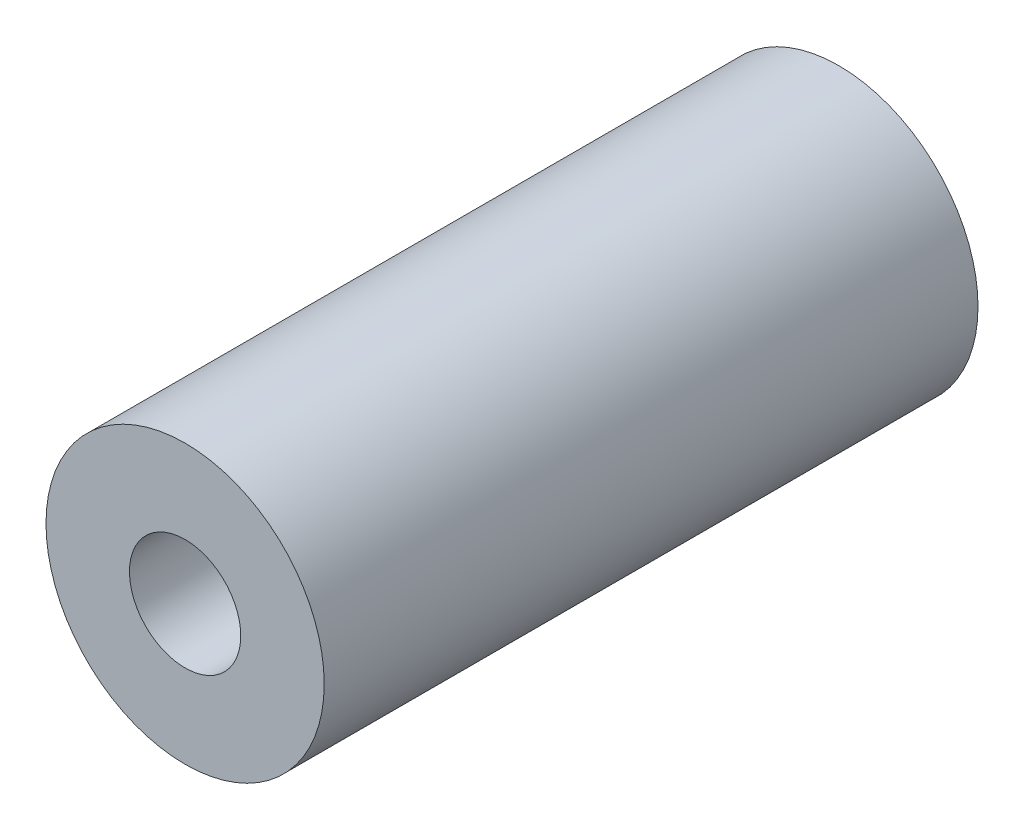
ISO-10303-21;
HEADER;
FILE_DESCRIPTION(('STEP AP214'),'2;1');
FILE_NAME('part.step','',(''),(''),'','','');
FILE_SCHEMA(('AUTOMOTIVE_DESIGN { 1 0 10303 214 1 1 1 1 }'));
ENDSEC;
DATA;
#1=APPLICATION_CONTEXT('core data for automotive mechanical design processes');
#2=APPLICATION_PROTOCOL_DEFINITION('international standard','automotive_design',2000,#1);
#3=PRODUCT_CONTEXT('',#1,'mechanical');
#4=PRODUCT('Part','Part','',(#3));
#5=PRODUCT_RELATED_PRODUCT_CATEGORY('part','',(#4));
#6=PRODUCT_DEFINITION_FORMATION('','',#4);
#7=PRODUCT_DEFINITION_CONTEXT('part definition',#1,'design');
#8=PRODUCT_DEFINITION('design','',#6,#7);
#9=PRODUCT_DEFINITION_SHAPE('','',#8);
#10=(LENGTH_UNIT() NAMED_UNIT(*) SI_UNIT(.MILLI.,.METRE.));
#11=(NAMED_UNIT(*) PLANE_ANGLE_UNIT() SI_UNIT($,.RADIAN.));
#12=(NAMED_UNIT(*) SI_UNIT($,.STERADIAN.) SOLID_ANGLE_UNIT());
#13=UNCERTAINTY_MEASURE_WITH_UNIT(LENGTH_MEASURE(1.E-05),#10,'distance_accuracy_value','');
#14=(GEOMETRIC_REPRESENTATION_CONTEXT(3) GLOBAL_UNCERTAINTY_ASSIGNED_CONTEXT((#13)) GLOBAL_UNIT_ASSIGNED_CONTEXT((#10,
#11,#12)) REPRESENTATION_CONTEXT('',''));
#15=CARTESIAN_POINT('',(0.,0.,0.));
#16=DIRECTION('',(0.,0.,1.));
#17=DIRECTION('',(1.,0.,0.));
#18=AXIS2_PLACEMENT_3D('',#15,#16,#17);
#19=CARTESIAN_POINT('',(0.,0.,0.));
#20=DIRECTION('',(0.,0.,-1.));
#21=DIRECTION('',(0.,1.,0.));
#22=AXIS2_PLACEMENT_3D('',#19,#20,#21);
#23=CYLINDRICAL_SURFACE('',#22,10.);
#24=CARTESIAN_POINT('',(0.,0.,0.));
#25=DIRECTION('',(0.,0.,-1.));
#26=DIRECTION('',(0.,1.,0.));
#27=AXIS2_PLACEMENT_3D('',#24,#25,#26);
#28=CIRCLE('',#27,10.);
#29=CARTESIAN_POINT('',(0.,10.,0.));
#30=VERTEX_POINT('',#29);
#31=EDGE_CURVE('E8',#30,#30,#28,.T.);
#32=ORIENTED_EDGE('',*,*,#31,.F.);
#33=EDGE_LOOP('',(#32));
#34=FACE_BOUND('',#33,.T.);
#35=CARTESIAN_POINT('',(0.,0.,47.));
#36=DIRECTION('',(0.,0.,-1.));
#37=DIRECTION('',(0.,1.,0.));
#38=AXIS2_PLACEMENT_3D('',#35,#36,#37);
#39=CIRCLE('',#38,10.);
#40=CARTESIAN_POINT('',(0.,10.,47.));
#41=VERTEX_POINT('',#40);
#42=EDGE_CURVE('E22',#41,#41,#39,.T.);
#43=ORIENTED_EDGE('',*,*,#42,.T.);
#44=EDGE_LOOP('',(#43));
#45=FACE_BOUND('',#44,.T.);
#46=ADVANCED_FACE('F12',(#34,#45),#23,.T.);
#47=CARTESIAN_POINT('',(5.,0.,0.));
#48=DIRECTION('',(0.,0.,-1.));
#49=DIRECTION('',(0.,1.,0.));
#50=AXIS2_PLACEMENT_3D('',#47,#48,#49);
#51=PLANE('',#50);
#52=ORIENTED_EDGE('',*,*,#31,.T.);
#53=EDGE_LOOP('',(#52));
#54=FACE_BOUND('',#53,.T.);
#55=ADVANCED_FACE('F46',(#54),#51,.T.);
#56=CARTESIAN_POINT('',(0.,0.,0.));
#57=DIRECTION('',(0.,0.,-1.));
#58=DIRECTION('',(0.,1.,0.));
#59=AXIS2_PLACEMENT_3D('',#56,#57,#58);
#60=CYLINDRICAL_SURFACE('',#59,4.);
#61=CARTESIAN_POINT('',(0.,0.,34.));
#62=DIRECTION('',(0.,0.,-1.));
#63=DIRECTION('',(0.,1.,0.));
#64=AXIS2_PLACEMENT_3D('',#61,#62,#63);
#65=CIRCLE('',#64,4.);
#66=CARTESIAN_POINT('',(0.,4.,34.));
#67=VERTEX_POINT('',#66);
#68=EDGE_CURVE('E26',#67,#67,#65,.T.);
#69=ORIENTED_EDGE('',*,*,#68,.T.);
#70=EDGE_LOOP('',(#69));
#71=FACE_BOUND('',#70,.T.);
#72=CARTESIAN_POINT('',(0.,0.,47.));
#73=DIRECTION('',(0.,0.,-1.));
#74=DIRECTION('',(0.,1.,0.));
#75=AXIS2_PLACEMENT_3D('',#72,#73,#74);
#76=CIRCLE('',#75,4.);
#77=CARTESIAN_POINT('',(0.,4.,47.));
#78=VERTEX_POINT('',#77);
#79=EDGE_CURVE('E18',#78,#78,#76,.T.);
#80=ORIENTED_EDGE('',*,*,#79,.F.);
#81=EDGE_LOOP('',(#80));
#82=FACE_BOUND('',#81,.T.);
#83=ADVANCED_FACE('F32',(#71,#82),#60,.F.);
#84=CARTESIAN_POINT('',(4.,0.,47.));
#85=DIRECTION('',(0.,0.,1.));
#86=DIRECTION('',(0.,-1.,0.));
#87=AXIS2_PLACEMENT_3D('',#84,#85,#86);
#88=PLANE('',#87);
#89=ORIENTED_EDGE('',*,*,#79,.T.);
#90=EDGE_LOOP('',(#89));
#91=FACE_BOUND('',#90,.T.);
#92=ORIENTED_EDGE('',*,*,#42,.F.);
#93=EDGE_LOOP('',(#92));
#94=FACE_BOUND('',#93,.T.);
#95=ADVANCED_FACE('F37',(#91,#94),#88,.T.);
#96=CARTESIAN_POINT('',(0.,0.,34.));
#97=DIRECTION('',(0.,0.,-1.));
#98=DIRECTION('',(0.,1.,0.));
#99=AXIS2_PLACEMENT_3D('',#96,#97,#98);
#100=PLANE('',#99);
#101=ORIENTED_EDGE('',*,*,#68,.F.);
#102=EDGE_LOOP('',(#101));
#103=FACE_BOUND('',#102,.T.);
#104=ADVANCED_FACE('F35',(#103),#100,.F.);
#105=CLOSED_SHELL('',(#46,#55,#83,#95,#104));
#106=MANIFOLD_SOLID_BREP('B1',#105);
#107=ADVANCED_BREP_SHAPE_REPRESENTATION('',(#18,#106),#14);
#108=SHAPE_DEFINITION_REPRESENTATION(#9,#107);
ENDSEC;
END-ISO-10303-21;
